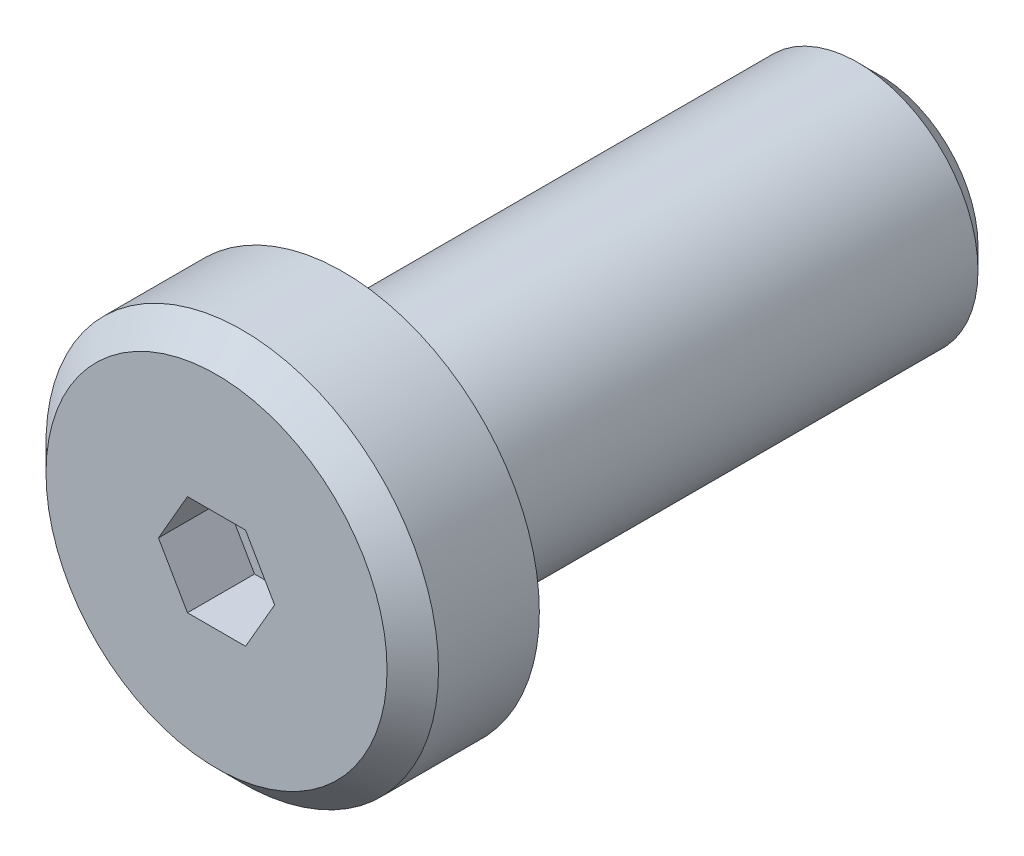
from build123d import *

# Parameters (mm, degrees)
SKETCH1_R           = 2.3241
HEAD_DEPTH          = 1.4986
SKETCH2_R           = 1.4224
SHANK_DEPTH         = 6.35
SOCKET_DEPTH        = 0.79375
BOTTOM_CHAMFER_SIZE = 0.254
TOP_CHAMFER_SIZE    = 0.3048


with BuildPart() as part:
    # Sketch1 → Head (new body)
    with BuildSketch(Plane.XY):
        Circle(SKETCH1_R)
    extrude(amount=-HEAD_DEPTH)

    # Sketch2 → Shank (add)
    with BuildSketch(Plane(origin=(0, 0, -1.4986), x_dir=(-1, 0, 0), z_dir=(0, 0, -1))):
        with Locations(Location((0, 0, 0), (0, 0, 180))):
            Circle(SKETCH2_R)
    extrude(amount=SHANK_DEPTH)

    # Sketch3 → Socket (cut)
    with BuildSketch(Plane.XY):
        Polygon((0.687774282, 0), (0.343887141, 0.59563), (-0.343887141, 0.59563), (-0.687774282, 0), (-0.343887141, -0.59563), (0.343887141, -0.59563), align=None)
    extrude(amount=-SOCKET_DEPTH, mode=Mode.SUBTRACT)

    # Bottom Chamfer
    bottom_chamfer_edges = [part.edges().sort_by_distance(p)[0] for p in [
        (-1.4224, 0, -7.8486),
    ]]
    chamfer(bottom_chamfer_edges, length=BOTTOM_CHAMFER_SIZE)

    # Top Chamfer
    top_chamfer_edges = [part.edges().sort_by_distance(p)[0] for p in [
        (-2.3241, 0, 0),
    ]]
    chamfer(top_chamfer_edges, length=TOP_CHAMFER_SIZE)


solid = part.part
